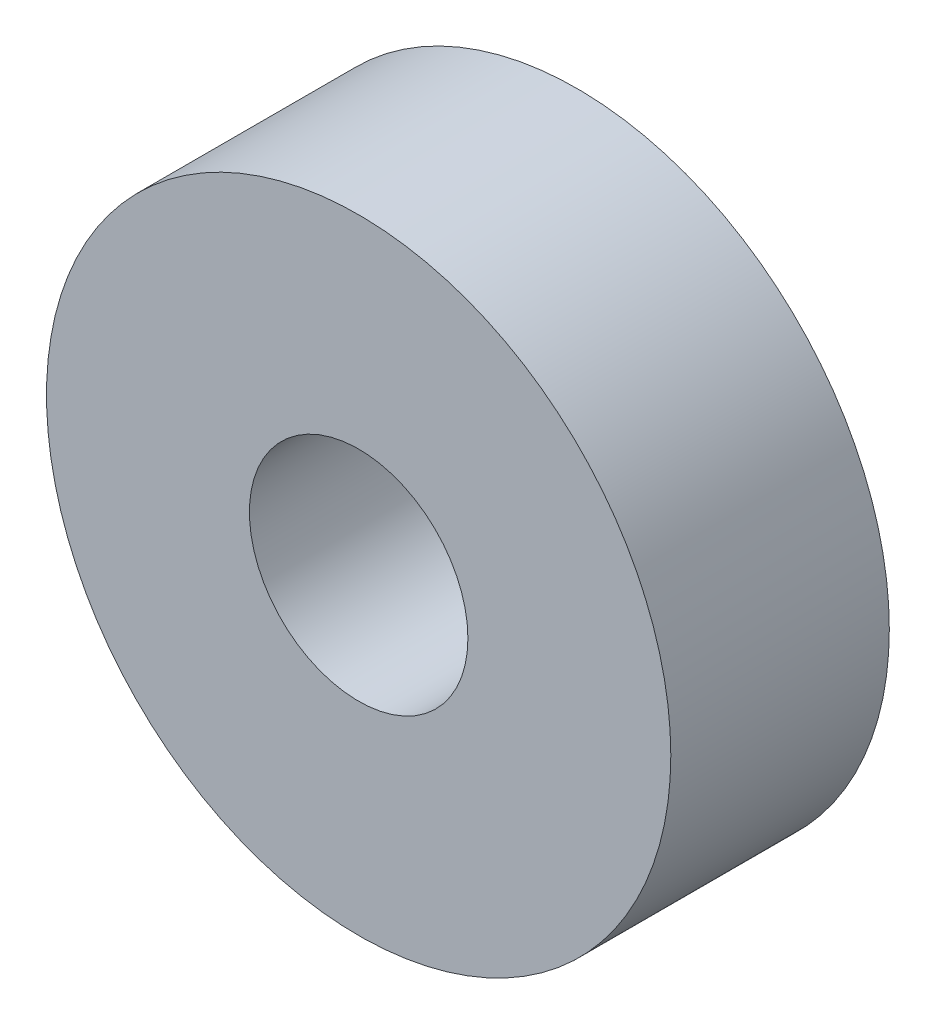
ISO-10303-21;
HEADER;
FILE_DESCRIPTION(('STEP AP214'),'2;1');
FILE_NAME('part.step','',(''),(''),'','','');
FILE_SCHEMA(('AUTOMOTIVE_DESIGN { 1 0 10303 214 1 1 1 1 }'));
ENDSEC;
DATA;
#1=APPLICATION_CONTEXT('core data for automotive mechanical design processes');
#2=APPLICATION_PROTOCOL_DEFINITION('international standard','automotive_design',2000,#1);
#3=PRODUCT_CONTEXT('',#1,'mechanical');
#4=PRODUCT('Part','Part','',(#3));
#5=PRODUCT_RELATED_PRODUCT_CATEGORY('part','',(#4));
#6=PRODUCT_DEFINITION_FORMATION('','',#4);
#7=PRODUCT_DEFINITION_CONTEXT('part definition',#1,'design');
#8=PRODUCT_DEFINITION('design','',#6,#7);
#9=PRODUCT_DEFINITION_SHAPE('','',#8);
#10=(LENGTH_UNIT() NAMED_UNIT(*) SI_UNIT(.MILLI.,.METRE.));
#11=(NAMED_UNIT(*) PLANE_ANGLE_UNIT() SI_UNIT($,.RADIAN.));
#12=(NAMED_UNIT(*) SI_UNIT($,.STERADIAN.) SOLID_ANGLE_UNIT());
#13=UNCERTAINTY_MEASURE_WITH_UNIT(LENGTH_MEASURE(1.E-05),#10,'distance_accuracy_value','');
#14=(GEOMETRIC_REPRESENTATION_CONTEXT(3) GLOBAL_UNCERTAINTY_ASSIGNED_CONTEXT((#13)) GLOBAL_UNIT_ASSIGNED_CONTEXT((#10,
#11,#12)) REPRESENTATION_CONTEXT('',''));
#15=CARTESIAN_POINT('',(0.,0.,0.));
#16=DIRECTION('',(0.,0.,1.));
#17=DIRECTION('',(1.,0.,0.));
#18=AXIS2_PLACEMENT_3D('',#15,#16,#17);
#19=CARTESIAN_POINT('',(-2.22044604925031E-13,1.11022302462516E-13,7.00000000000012));
#20=DIRECTION('',(0.,0.,1.));
#21=DIRECTION('',(1.00000000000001,0.,0.));
#22=AXIS2_PLACEMENT_3D('',#19,#20,#21);
#23=PLANE('',#22);
#24=CARTESIAN_POINT('',(-2.22044604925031E-13,1.11022302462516E-13,7.00000000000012));
#25=DIRECTION('',(0.,0.,1.));
#26=DIRECTION('',(1.00000000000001,0.,0.));
#27=AXIS2_PLACEMENT_3D('',#24,#25,#26);
#28=CIRCLE('',#27,10.);
#29=CARTESIAN_POINT('',(9.9999999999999,1.11022302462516E-13,7.00000000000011));
#30=VERTEX_POINT('',#29);
#31=EDGE_CURVE('E10',#30,#30,#28,.T.);
#32=ORIENTED_EDGE('',*,*,#31,.T.);
#33=EDGE_LOOP('',(#32));
#34=FACE_BOUND('',#33,.T.);
#35=CARTESIAN_POINT('',(-2.22044604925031E-13,1.11022302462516E-13,7.00000000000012));
#36=DIRECTION('',(0.,0.,1.));
#37=DIRECTION('',(1.00000000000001,0.,0.));
#38=AXIS2_PLACEMENT_3D('',#35,#36,#37);
#39=CIRCLE('',#38,3.5);
#40=CARTESIAN_POINT('',(3.49999999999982,1.11022302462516E-13,7.00000000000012));
#41=VERTEX_POINT('',#40);
#42=EDGE_CURVE('E53',#41,#41,#39,.T.);
#43=ORIENTED_EDGE('',*,*,#42,.F.);
#44=EDGE_LOOP('',(#43));
#45=FACE_BOUND('',#44,.T.);
#46=ADVANCED_FACE('F38',(#34,#45),#23,.T.);
#47=CARTESIAN_POINT('',(0.,0.,0.));
#48=DIRECTION('',(0.,0.,1.));
#49=DIRECTION('',(1.00000000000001,0.,0.));
#50=AXIS2_PLACEMENT_3D('',#47,#48,#49);
#51=PLANE('',#50);
#52=CARTESIAN_POINT('',(0.,0.,0.));
#53=DIRECTION('',(0.,0.,1.));
#54=DIRECTION('',(1.00000000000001,0.,0.));
#55=AXIS2_PLACEMENT_3D('',#52,#53,#54);
#56=CIRCLE('',#55,10.);
#57=CARTESIAN_POINT('',(10.0000000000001,0.,0.));
#58=VERTEX_POINT('',#57);
#59=EDGE_CURVE('E42',#58,#58,#56,.T.);
#60=ORIENTED_EDGE('',*,*,#59,.F.);
#61=EDGE_LOOP('',(#60));
#62=FACE_BOUND('',#61,.T.);
#63=CARTESIAN_POINT('',(0.,0.,0.));
#64=DIRECTION('',(0.,0.,1.));
#65=DIRECTION('',(1.00000000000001,0.,0.));
#66=AXIS2_PLACEMENT_3D('',#63,#64,#65);
#67=CIRCLE('',#66,3.5);
#68=CARTESIAN_POINT('',(3.50000000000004,0.,0.));
#69=VERTEX_POINT('',#68);
#70=EDGE_CURVE('E55',#69,#69,#67,.T.);
#71=ORIENTED_EDGE('',*,*,#70,.T.);
#72=EDGE_LOOP('',(#71));
#73=FACE_BOUND('',#72,.T.);
#74=ADVANCED_FACE('F69',(#62,#73),#51,.F.);
#75=CARTESIAN_POINT('',(-2.22044604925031E-13,1.11022302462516E-13,7.00000000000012));
#76=DIRECTION('',(0.,0.,-1.));
#77=DIRECTION('',(-1.00000000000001,0.,0.));
#78=AXIS2_PLACEMENT_3D('',#75,#76,#77);
#79=CYLINDRICAL_SURFACE('',#78,10.);
#80=ORIENTED_EDGE('',*,*,#31,.F.);
#81=EDGE_LOOP('',(#80));
#82=FACE_BOUND('',#81,.T.);
#83=ORIENTED_EDGE('',*,*,#59,.T.);
#84=EDGE_LOOP('',(#83));
#85=FACE_BOUND('',#84,.T.);
#86=ADVANCED_FACE('F40',(#82,#85),#79,.T.);
#87=CARTESIAN_POINT('',(-2.22044604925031E-13,1.11022302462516E-13,7.00000000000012));
#88=DIRECTION('',(0.,0.,-1.));
#89=DIRECTION('',(-1.00000000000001,0.,0.));
#90=AXIS2_PLACEMENT_3D('',#87,#88,#89);
#91=CYLINDRICAL_SURFACE('',#90,3.5);
#92=ORIENTED_EDGE('',*,*,#42,.T.);
#93=EDGE_LOOP('',(#92));
#94=FACE_BOUND('',#93,.T.);
#95=ORIENTED_EDGE('',*,*,#70,.F.);
#96=EDGE_LOOP('',(#95));
#97=FACE_BOUND('',#96,.T.);
#98=ADVANCED_FACE('F65',(#94,#97),#91,.F.);
#99=CLOSED_SHELL('',(#46,#74,#86,#98));
#100=MANIFOLD_SOLID_BREP('B2',#99);
#101=ADVANCED_BREP_SHAPE_REPRESENTATION('',(#18,#100),#14);
#102=SHAPE_DEFINITION_REPRESENTATION(#9,#101);
ENDSEC;
END-ISO-10303-21;
